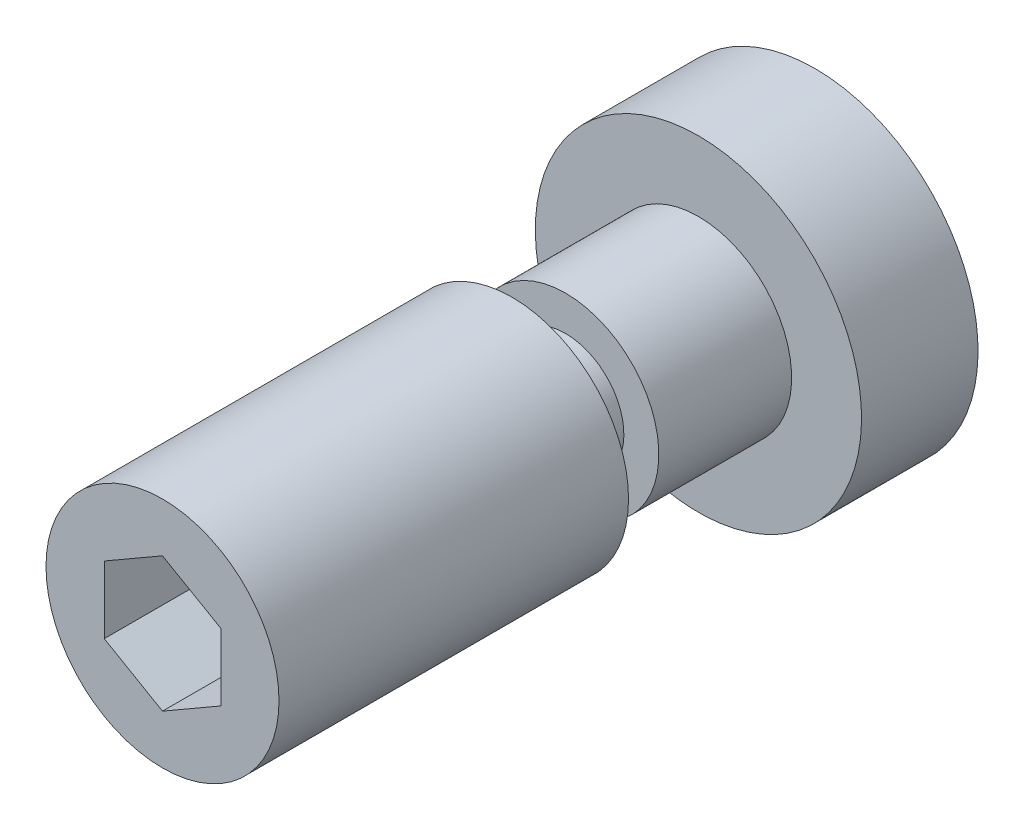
ISO-10303-21;
HEADER;
FILE_DESCRIPTION(('STEP AP214'),'2;1');
FILE_NAME('part.step','',(''),(''),'','','');
FILE_SCHEMA(('AUTOMOTIVE_DESIGN { 1 0 10303 214 1 1 1 1 }'));
ENDSEC;
DATA;
#1=APPLICATION_CONTEXT('core data for automotive mechanical design processes');
#2=APPLICATION_PROTOCOL_DEFINITION('international standard','automotive_design',2000,#1);
#3=PRODUCT_CONTEXT('',#1,'mechanical');
#4=PRODUCT('Part','Part','',(#3));
#5=PRODUCT_RELATED_PRODUCT_CATEGORY('part','',(#4));
#6=PRODUCT_DEFINITION_FORMATION('','',#4);
#7=PRODUCT_DEFINITION_CONTEXT('part definition',#1,'design');
#8=PRODUCT_DEFINITION('design','',#6,#7);
#9=PRODUCT_DEFINITION_SHAPE('','',#8);
#10=(LENGTH_UNIT() NAMED_UNIT(*) SI_UNIT(.MILLI.,.METRE.));
#11=(NAMED_UNIT(*) PLANE_ANGLE_UNIT() SI_UNIT($,.RADIAN.));
#12=(NAMED_UNIT(*) SI_UNIT($,.STERADIAN.) SOLID_ANGLE_UNIT());
#13=UNCERTAINTY_MEASURE_WITH_UNIT(LENGTH_MEASURE(1.E-05),#10,'distance_accuracy_value','');
#14=(GEOMETRIC_REPRESENTATION_CONTEXT(3) GLOBAL_UNCERTAINTY_ASSIGNED_CONTEXT((#13)) GLOBAL_UNIT_ASSIGNED_CONTEXT((#10,
#11,#12)) REPRESENTATION_CONTEXT('',''));
#15=CARTESIAN_POINT('',(0.,0.,0.));
#16=DIRECTION('',(0.,0.,1.));
#17=DIRECTION('',(1.,0.,0.));
#18=AXIS2_PLACEMENT_3D('',#15,#16,#17);
#19=CARTESIAN_POINT('',(0.,0.,0.));
#20=DIRECTION('',(0.,0.,1.));
#21=DIRECTION('',(0.,1.,0.));
#22=AXIS2_PLACEMENT_3D('',#19,#20,#21);
#23=PLANE('',#22);
#24=CARTESIAN_POINT('',(0.,0.,0.));
#25=DIRECTION('',(0.,0.,1.));
#26=DIRECTION('',(0.,1.,0.));
#27=AXIS2_PLACEMENT_3D('',#24,#25,#26);
#28=CIRCLE('',#27,7.);
#29=CARTESIAN_POINT('',(0.,7.,0.));
#30=VERTEX_POINT('',#29);
#31=EDGE_CURVE('E9',#30,#30,#28,.T.);
#32=ORIENTED_EDGE('',*,*,#31,.F.);
#33=EDGE_LOOP('',(#32));
#34=FACE_BOUND('',#33,.T.);
#35=ADVANCED_FACE('F14',(#34),#23,.F.);
#36=CARTESIAN_POINT('',(0.,0.,40.));
#37=DIRECTION('',(0.,0.,1.));
#38=DIRECTION('',(0.,1.,0.));
#39=AXIS2_PLACEMENT_3D('',#36,#37,#38);
#40=CYLINDRICAL_SURFACE('',#39,7.);
#41=CARTESIAN_POINT('',(0.,0.,5.));
#42=DIRECTION('',(0.,0.,1.));
#43=DIRECTION('',(0.,1.,0.));
#44=AXIS2_PLACEMENT_3D('',#41,#42,#43);
#45=CIRCLE('',#44,7.);
#46=CARTESIAN_POINT('',(0.,7.,5.));
#47=VERTEX_POINT('',#46);
#48=EDGE_CURVE('E21',#47,#47,#45,.T.);
#49=ORIENTED_EDGE('',*,*,#48,.F.);
#50=EDGE_LOOP('',(#49));
#51=FACE_BOUND('',#50,.T.);
#52=ORIENTED_EDGE('',*,*,#31,.T.);
#53=EDGE_LOOP('',(#52));
#54=FACE_BOUND('',#53,.T.);
#55=ADVANCED_FACE('F142',(#51,#54),#40,.T.);
#56=CARTESIAN_POINT('',(0.,-7.,5.));
#57=DIRECTION('',(0.,0.,-1.));
#58=DIRECTION('',(0.,-1.,0.));
#59=AXIS2_PLACEMENT_3D('',#56,#57,#58);
#60=PLANE('',#59);
#61=CARTESIAN_POINT('',(0.,0.,5.));
#62=DIRECTION('',(0.,0.,1.));
#63=DIRECTION('',(0.,1.,0.));
#64=AXIS2_PLACEMENT_3D('',#61,#62,#63);
#65=CIRCLE('',#64,4.);
#66=CARTESIAN_POINT('',(0.,4.,5.));
#67=VERTEX_POINT('',#66);
#68=EDGE_CURVE('E135',#67,#67,#65,.T.);
#69=ORIENTED_EDGE('',*,*,#68,.F.);
#70=EDGE_LOOP('',(#69));
#71=FACE_BOUND('',#70,.T.);
#72=ORIENTED_EDGE('',*,*,#48,.T.);
#73=EDGE_LOOP('',(#72));
#74=FACE_BOUND('',#73,.T.);
#75=ADVANCED_FACE('F140',(#71,#74),#60,.F.);
#76=CARTESIAN_POINT('',(0.,0.,40.));
#77=DIRECTION('',(0.,0.,1.));
#78=DIRECTION('',(0.,1.,0.));
#79=AXIS2_PLACEMENT_3D('',#76,#77,#78);
#80=CYLINDRICAL_SURFACE('',#79,4.);
#81=CARTESIAN_POINT('',(0.,0.,10.7));
#82=DIRECTION('',(0.,0.,1.));
#83=DIRECTION('',(0.,1.,0.));
#84=AXIS2_PLACEMENT_3D('',#81,#82,#83);
#85=CIRCLE('',#84,4.);
#86=CARTESIAN_POINT('',(0.,4.,10.7));
#87=VERTEX_POINT('',#86);
#88=EDGE_CURVE('E132',#87,#87,#85,.T.);
#89=ORIENTED_EDGE('',*,*,#88,.F.);
#90=EDGE_LOOP('',(#89));
#91=FACE_BOUND('',#90,.T.);
#92=ORIENTED_EDGE('',*,*,#68,.T.);
#93=EDGE_LOOP('',(#92));
#94=FACE_BOUND('',#93,.T.);
#95=ADVANCED_FACE('F165',(#91,#94),#80,.T.);
#96=CARTESIAN_POINT('',(0.,-4.,10.7));
#97=DIRECTION('',(0.,0.,-1.));
#98=DIRECTION('',(0.,-1.,0.));
#99=AXIS2_PLACEMENT_3D('',#96,#97,#98);
#100=PLANE('',#99);
#101=CARTESIAN_POINT('',(0.,0.,10.7));
#102=DIRECTION('',(0.,0.,1.));
#103=DIRECTION('',(0.,1.,0.));
#104=AXIS2_PLACEMENT_3D('',#101,#102,#103);
#105=CIRCLE('',#104,2.5);
#106=CARTESIAN_POINT('',(0.,2.5,10.7));
#107=VERTEX_POINT('',#106);
#108=EDGE_CURVE('E129',#107,#107,#105,.T.);
#109=ORIENTED_EDGE('',*,*,#108,.F.);
#110=EDGE_LOOP('',(#109));
#111=FACE_BOUND('',#110,.T.);
#112=ORIENTED_EDGE('',*,*,#88,.T.);
#113=EDGE_LOOP('',(#112));
#114=FACE_BOUND('',#113,.T.);
#115=ADVANCED_FACE('F174',(#111,#114),#100,.F.);
#116=CARTESIAN_POINT('',(0.,0.,40.));
#117=DIRECTION('',(0.,0.,1.));
#118=DIRECTION('',(0.,1.,0.));
#119=AXIS2_PLACEMENT_3D('',#116,#117,#118);
#120=CYLINDRICAL_SURFACE('',#119,2.5);
#121=CARTESIAN_POINT('',(0.,0.,13.));
#122=DIRECTION('',(0.,0.,1.));
#123=DIRECTION('',(0.,1.,0.));
#124=AXIS2_PLACEMENT_3D('',#121,#122,#123);
#125=CIRCLE('',#124,2.5);
#126=CARTESIAN_POINT('',(0.,2.5,13.));
#127=VERTEX_POINT('',#126);
#128=EDGE_CURVE('E126',#127,#127,#125,.T.);
#129=ORIENTED_EDGE('',*,*,#128,.F.);
#130=EDGE_LOOP('',(#129));
#131=FACE_BOUND('',#130,.T.);
#132=ORIENTED_EDGE('',*,*,#108,.T.);
#133=EDGE_LOOP('',(#132));
#134=FACE_BOUND('',#133,.T.);
#135=ADVANCED_FACE('F183',(#131,#134),#120,.T.);
#136=CARTESIAN_POINT('',(0.,-2.5,13.));
#137=DIRECTION('',(0.,0.,1.));
#138=DIRECTION('',(0.,1.,0.));
#139=AXIS2_PLACEMENT_3D('',#136,#137,#138);
#140=PLANE('',#139);
#141=CARTESIAN_POINT('',(0.,0.,13.));
#142=DIRECTION('',(0.,0.,1.));
#143=DIRECTION('',(0.,1.,0.));
#144=AXIS2_PLACEMENT_3D('',#141,#142,#143);
#145=CIRCLE('',#144,5.);
#146=CARTESIAN_POINT('',(0.,5.,13.));
#147=VERTEX_POINT('',#146);
#148=EDGE_CURVE('E123',#147,#147,#145,.T.);
#149=ORIENTED_EDGE('',*,*,#148,.F.);
#150=EDGE_LOOP('',(#149));
#151=FACE_BOUND('',#150,.T.);
#152=ORIENTED_EDGE('',*,*,#128,.T.);
#153=EDGE_LOOP('',(#152));
#154=FACE_BOUND('',#153,.T.);
#155=ADVANCED_FACE('F192',(#151,#154),#140,.F.);
#156=CARTESIAN_POINT('',(0.,0.,40.));
#157=DIRECTION('',(0.,0.,1.));
#158=DIRECTION('',(0.,1.,0.));
#159=AXIS2_PLACEMENT_3D('',#156,#157,#158);
#160=CYLINDRICAL_SURFACE('',#159,5.);
#161=CARTESIAN_POINT('',(0.,0.,28.));
#162=DIRECTION('',(0.,0.,1.));
#163=DIRECTION('',(0.,1.,0.));
#164=AXIS2_PLACEMENT_3D('',#161,#162,#163);
#165=CIRCLE('',#164,5.);
#166=CARTESIAN_POINT('',(0.,5.,28.));
#167=VERTEX_POINT('',#166);
#168=EDGE_CURVE('E115',#167,#167,#165,.T.);
#169=ORIENTED_EDGE('',*,*,#168,.F.);
#170=EDGE_LOOP('',(#169));
#171=FACE_BOUND('',#170,.T.);
#172=ORIENTED_EDGE('',*,*,#148,.T.);
#173=EDGE_LOOP('',(#172));
#174=FACE_BOUND('',#173,.T.);
#175=ADVANCED_FACE('F201',(#171,#174),#160,.T.);
#176=CARTESIAN_POINT('',(0.,-5.,28.));
#177=DIRECTION('',(0.,0.,-1.));
#178=DIRECTION('',(0.,-1.,0.));
#179=AXIS2_PLACEMENT_3D('',#176,#177,#178);
#180=PLANE('',#179);
#181=DIRECTION('',(-0.866025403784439,-0.5,0.));
#182=VECTOR('',#181,1.);
#183=CARTESIAN_POINT('',(0.,2.88675134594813,28.));
#184=LINE('',#183,#182);
#185=CARTESIAN_POINT('',(0.,2.88675134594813,28.));
#186=VERTEX_POINT('',#185);
#187=CARTESIAN_POINT('',(-2.5,1.44337567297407,28.));
#188=VERTEX_POINT('',#187);
#189=EDGE_CURVE('E102',#186,#188,#184,.T.);
#190=ORIENTED_EDGE('',*,*,#189,.F.);
#191=DIRECTION('',(-0.866025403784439,0.5,0.));
#192=VECTOR('',#191,1.);
#193=CARTESIAN_POINT('',(2.5,1.44337567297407,28.));
#194=LINE('',#193,#192);
#195=CARTESIAN_POINT('',(2.5,1.44337567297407,28.));
#196=VERTEX_POINT('',#195);
#197=EDGE_CURVE('E28',#196,#186,#194,.T.);
#198=ORIENTED_EDGE('',*,*,#197,.F.);
#199=DIRECTION('',(0.,1.,0.));
#200=VECTOR('',#199,1.);
#201=CARTESIAN_POINT('',(2.5,-1.44337567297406,28.));
#202=LINE('',#201,#200);
#203=CARTESIAN_POINT('',(2.5,-1.44337567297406,28.));
#204=VERTEX_POINT('',#203);
#205=EDGE_CURVE('E111',#204,#196,#202,.T.);
#206=ORIENTED_EDGE('',*,*,#205,.F.);
#207=DIRECTION('',(0.866025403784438,0.5,0.));
#208=VECTOR('',#207,1.);
#209=CARTESIAN_POINT('',(0.,-2.88675134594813,28.));
#210=LINE('',#209,#208);
#211=CARTESIAN_POINT('',(0.,-2.88675134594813,28.));
#212=VERTEX_POINT('',#211);
#213=EDGE_CURVE('E109',#212,#204,#210,.T.);
#214=ORIENTED_EDGE('',*,*,#213,.F.);
#215=DIRECTION('',(0.866025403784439,-0.5,0.));
#216=VECTOR('',#215,1.);
#217=CARTESIAN_POINT('',(-2.5,-1.44337567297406,28.));
#218=LINE('',#217,#216);
#219=CARTESIAN_POINT('',(-2.5,-1.44337567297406,28.));
#220=VERTEX_POINT('',#219);
#221=EDGE_CURVE('E76',#220,#212,#218,.T.);
#222=ORIENTED_EDGE('',*,*,#221,.F.);
#223=DIRECTION('',(0.,-1.,0.));
#224=VECTOR('',#223,1.);
#225=CARTESIAN_POINT('',(-2.5,1.44337567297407,28.));
#226=LINE('',#225,#224);
#227=EDGE_CURVE('E105',#188,#220,#226,.T.);
#228=ORIENTED_EDGE('',*,*,#227,.F.);
#229=EDGE_LOOP('',(#190,#198,#206,#214,#222,#228));
#230=FACE_BOUND('',#229,.T.);
#231=ORIENTED_EDGE('',*,*,#168,.T.);
#232=EDGE_LOOP('',(#231));
#233=FACE_BOUND('',#232,.T.);
#234=ADVANCED_FACE('F210',(#230,#233),#180,.F.);
#235=CARTESIAN_POINT('',(2.5,1.44337567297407,22.));
#236=DIRECTION('',(0.5,0.866025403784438,0.));
#237=DIRECTION('',(-0.866025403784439,0.5,0.));
#238=AXIS2_PLACEMENT_3D('',#235,#236,#237);
#239=PLANE('',#238);
#240=ORIENTED_EDGE('',*,*,#197,.T.);
#241=DIRECTION('',(0.,0.,1.));
#242=VECTOR('',#241,1.);
#243=CARTESIAN_POINT('',(0.,2.88675134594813,22.));
#244=LINE('',#243,#242);
#245=CARTESIAN_POINT('',(0.,2.88675134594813,22.));
#246=VERTEX_POINT('',#245);
#247=EDGE_CURVE('E58',#246,#186,#244,.T.);
#248=ORIENTED_EDGE('',*,*,#247,.F.);
#249=DIRECTION('',(-0.866025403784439,0.5,0.));
#250=VECTOR('',#249,1.);
#251=CARTESIAN_POINT('',(2.5,1.44337567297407,22.));
#252=LINE('',#251,#250);
#253=CARTESIAN_POINT('',(2.5,1.44337567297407,22.));
#254=VERTEX_POINT('',#253);
#255=EDGE_CURVE('E113',#254,#246,#252,.T.);
#256=ORIENTED_EDGE('',*,*,#255,.F.);
#257=DIRECTION('',(0.,0.,1.));
#258=VECTOR('',#257,1.);
#259=CARTESIAN_POINT('',(2.5,1.44337567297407,22.));
#260=LINE('',#259,#258);
#261=EDGE_CURVE('E36',#254,#196,#260,.T.);
#262=ORIENTED_EDGE('',*,*,#261,.T.);
#263=EDGE_LOOP('',(#240,#248,#256,#262));
#264=FACE_BOUND('',#263,.T.);
#265=ADVANCED_FACE('F219',(#264),#239,.F.);
#266=CARTESIAN_POINT('',(2.5,-1.44337567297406,22.));
#267=DIRECTION('',(1.,0.,0.));
#268=DIRECTION('',(0.,0.,-1.));
#269=AXIS2_PLACEMENT_3D('',#266,#267,#268);
#270=PLANE('',#269);
#271=ORIENTED_EDGE('',*,*,#205,.T.);
#272=ORIENTED_EDGE('',*,*,#261,.F.);
#273=DIRECTION('',(0.,1.,0.));
#274=VECTOR('',#273,1.);
#275=CARTESIAN_POINT('',(2.5,-1.44337567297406,22.));
#276=LINE('',#275,#274);
#277=CARTESIAN_POINT('',(2.5,-1.44337567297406,22.));
#278=VERTEX_POINT('',#277);
#279=EDGE_CURVE('E88',#278,#254,#276,.T.);
#280=ORIENTED_EDGE('',*,*,#279,.F.);
#281=DIRECTION('',(0.,0.,1.));
#282=VECTOR('',#281,1.);
#283=CARTESIAN_POINT('',(2.5,-1.44337567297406,22.));
#284=LINE('',#283,#282);
#285=EDGE_CURVE('E80',#278,#204,#284,.T.);
#286=ORIENTED_EDGE('',*,*,#285,.T.);
#287=EDGE_LOOP('',(#271,#272,#280,#286));
#288=FACE_BOUND('',#287,.T.);
#289=ADVANCED_FACE('F228',(#288),#270,.F.);
#290=CARTESIAN_POINT('',(0.,-2.88675134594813,22.));
#291=DIRECTION('',(0.5,-0.866025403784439,0.));
#292=DIRECTION('',(0.866025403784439,0.5,0.));
#293=AXIS2_PLACEMENT_3D('',#290,#291,#292);
#294=PLANE('',#293);
#295=ORIENTED_EDGE('',*,*,#213,.T.);
#296=ORIENTED_EDGE('',*,*,#285,.F.);
#297=DIRECTION('',(0.866025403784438,0.5,0.));
#298=VECTOR('',#297,1.);
#299=CARTESIAN_POINT('',(0.,-2.88675134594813,22.));
#300=LINE('',#299,#298);
#301=CARTESIAN_POINT('',(0.,-2.88675134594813,22.));
#302=VERTEX_POINT('',#301);
#303=EDGE_CURVE('E84',#302,#278,#300,.T.);
#304=ORIENTED_EDGE('',*,*,#303,.F.);
#305=DIRECTION('',(0.,0.,1.));
#306=VECTOR('',#305,1.);
#307=CARTESIAN_POINT('',(0.,-2.88675134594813,22.));
#308=LINE('',#307,#306);
#309=EDGE_CURVE('E69',#302,#212,#308,.T.);
#310=ORIENTED_EDGE('',*,*,#309,.T.);
#311=EDGE_LOOP('',(#295,#296,#304,#310));
#312=FACE_BOUND('',#311,.T.);
#313=ADVANCED_FACE('F85',(#312),#294,.F.);
#314=CARTESIAN_POINT('',(-2.5,-1.44337567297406,22.));
#315=DIRECTION('',(-0.5,-0.866025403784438,0.));
#316=DIRECTION('',(0.866025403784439,-0.5,0.));
#317=AXIS2_PLACEMENT_3D('',#314,#315,#316);
#318=PLANE('',#317);
#319=ORIENTED_EDGE('',*,*,#221,.T.);
#320=ORIENTED_EDGE('',*,*,#309,.F.);
#321=DIRECTION('',(0.866025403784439,-0.5,0.));
#322=VECTOR('',#321,1.);
#323=CARTESIAN_POINT('',(-2.5,-1.44337567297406,22.));
#324=LINE('',#323,#322);
#325=CARTESIAN_POINT('',(-2.5,-1.44337567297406,22.));
#326=VERTEX_POINT('',#325);
#327=EDGE_CURVE('E73',#326,#302,#324,.T.);
#328=ORIENTED_EDGE('',*,*,#327,.F.);
#329=DIRECTION('',(0.,0.,1.));
#330=VECTOR('',#329,1.);
#331=CARTESIAN_POINT('',(-2.5,-1.44337567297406,22.));
#332=LINE('',#331,#330);
#333=EDGE_CURVE('E81',#326,#220,#332,.T.);
#334=ORIENTED_EDGE('',*,*,#333,.T.);
#335=EDGE_LOOP('',(#319,#320,#328,#334));
#336=FACE_BOUND('',#335,.T.);
#337=ADVANCED_FACE('F71',(#336),#318,.F.);
#338=CARTESIAN_POINT('',(-2.5,1.44337567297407,22.));
#339=DIRECTION('',(-1.,0.,0.));
#340=DIRECTION('',(0.,-1.,0.));
#341=AXIS2_PLACEMENT_3D('',#338,#339,#340);
#342=PLANE('',#341);
#343=ORIENTED_EDGE('',*,*,#227,.T.);
#344=ORIENTED_EDGE('',*,*,#333,.F.);
#345=DIRECTION('',(0.,-1.,0.));
#346=VECTOR('',#345,1.);
#347=CARTESIAN_POINT('',(-2.5,1.44337567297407,22.));
#348=LINE('',#347,#346);
#349=CARTESIAN_POINT('',(-2.5,1.44337567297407,22.));
#350=VERTEX_POINT('',#349);
#351=EDGE_CURVE('E94',#350,#326,#348,.T.);
#352=ORIENTED_EDGE('',*,*,#351,.F.);
#353=DIRECTION('',(0.,0.,1.));
#354=VECTOR('',#353,1.);
#355=CARTESIAN_POINT('',(-2.5,1.44337567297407,22.));
#356=LINE('',#355,#354);
#357=EDGE_CURVE('E118',#350,#188,#356,.T.);
#358=ORIENTED_EDGE('',*,*,#357,.T.);
#359=EDGE_LOOP('',(#343,#344,#352,#358));
#360=FACE_BOUND('',#359,.T.);
#361=ADVANCED_FACE('F250',(#360),#342,.F.);
#362=CARTESIAN_POINT('',(0.,2.88675134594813,22.));
#363=DIRECTION('',(-0.5,0.866025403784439,0.));
#364=DIRECTION('',(-0.866025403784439,-0.5,0.));
#365=AXIS2_PLACEMENT_3D('',#362,#363,#364);
#366=PLANE('',#365);
#367=ORIENTED_EDGE('',*,*,#189,.T.);
#368=ORIENTED_EDGE('',*,*,#357,.F.);
#369=DIRECTION('',(-0.866025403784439,-0.5,0.));
#370=VECTOR('',#369,1.);
#371=CARTESIAN_POINT('',(0.,2.88675134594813,22.));
#372=LINE('',#371,#370);
#373=EDGE_CURVE('E96',#246,#350,#372,.T.);
#374=ORIENTED_EDGE('',*,*,#373,.F.);
#375=ORIENTED_EDGE('',*,*,#247,.T.);
#376=EDGE_LOOP('',(#367,#368,#374,#375));
#377=FACE_BOUND('',#376,.T.);
#378=ADVANCED_FACE('F258',(#377),#366,.F.);
#379=CARTESIAN_POINT('',(0.,2.88675134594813,22.));
#380=DIRECTION('',(0.,0.,1.));
#381=DIRECTION('',(1.,0.,0.));
#382=AXIS2_PLACEMENT_3D('',#379,#380,#381);
#383=PLANE('',#382);
#384=ORIENTED_EDGE('',*,*,#255,.T.);
#385=ORIENTED_EDGE('',*,*,#373,.T.);
#386=ORIENTED_EDGE('',*,*,#351,.T.);
#387=ORIENTED_EDGE('',*,*,#327,.T.);
#388=ORIENTED_EDGE('',*,*,#303,.T.);
#389=ORIENTED_EDGE('',*,*,#279,.T.);
#390=EDGE_LOOP('',(#384,#385,#386,#387,#388,#389));
#391=FACE_BOUND('',#390,.T.);
#392=ADVANCED_FACE('F91',(#391),#383,.T.);
#393=CLOSED_SHELL('',(#35,#55,#75,#95,#115,#135,#155,#175,#234,#265,#289,#313,#337,#361,#378,#392));
#394=MANIFOLD_SOLID_BREP('B1',#393);
#395=ADVANCED_BREP_SHAPE_REPRESENTATION('',(#18,#394),#14);
#396=SHAPE_DEFINITION_REPRESENTATION(#9,#395);
ENDSEC;
END-ISO-10303-21;
